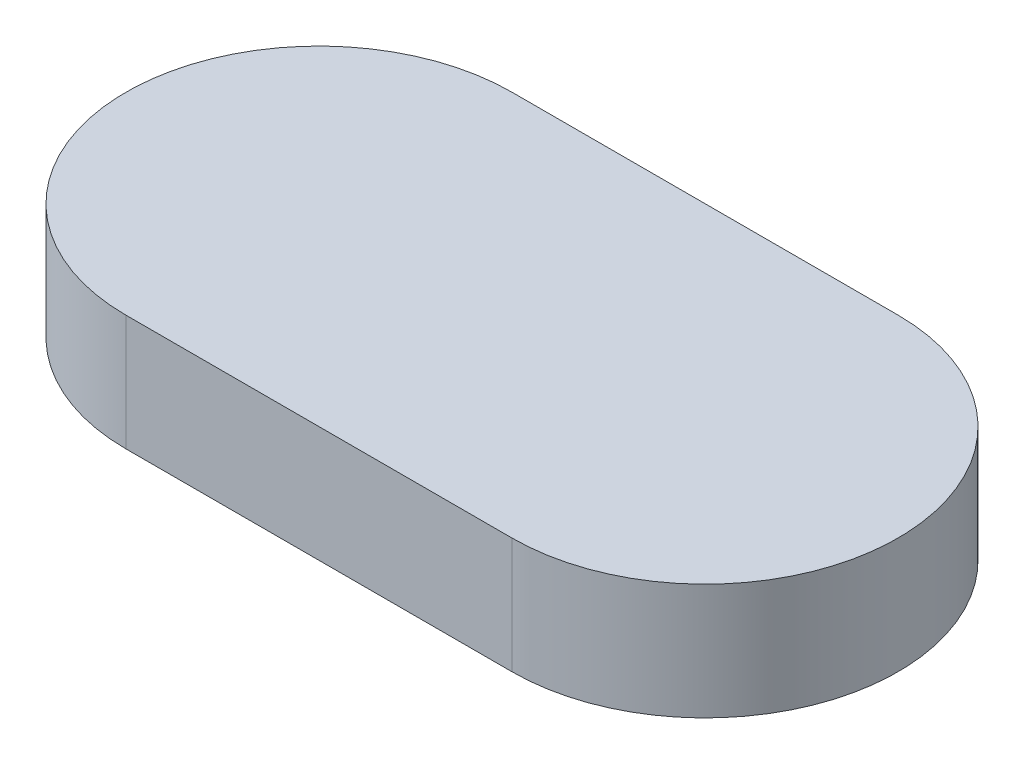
ISO-10303-21;
HEADER;
FILE_DESCRIPTION(('STEP AP214'),'2;1');
FILE_NAME('part.step','',(''),(''),'','','');
FILE_SCHEMA(('AUTOMOTIVE_DESIGN { 1 0 10303 214 1 1 1 1 }'));
ENDSEC;
DATA;
#1=APPLICATION_CONTEXT('core data for automotive mechanical design processes');
#2=APPLICATION_PROTOCOL_DEFINITION('international standard','automotive_design',2000,#1);
#3=PRODUCT_CONTEXT('',#1,'mechanical');
#4=PRODUCT('Part','Part','',(#3));
#5=PRODUCT_RELATED_PRODUCT_CATEGORY('part','',(#4));
#6=PRODUCT_DEFINITION_FORMATION('','',#4);
#7=PRODUCT_DEFINITION_CONTEXT('part definition',#1,'design');
#8=PRODUCT_DEFINITION('design','',#6,#7);
#9=PRODUCT_DEFINITION_SHAPE('','',#8);
#10=(LENGTH_UNIT() NAMED_UNIT(*) SI_UNIT(.MILLI.,.METRE.));
#11=(NAMED_UNIT(*) PLANE_ANGLE_UNIT() SI_UNIT($,.RADIAN.));
#12=(NAMED_UNIT(*) SI_UNIT($,.STERADIAN.) SOLID_ANGLE_UNIT());
#13=UNCERTAINTY_MEASURE_WITH_UNIT(LENGTH_MEASURE(1.E-05),#10,'distance_accuracy_value','');
#14=(GEOMETRIC_REPRESENTATION_CONTEXT(3) GLOBAL_UNCERTAINTY_ASSIGNED_CONTEXT((#13)) GLOBAL_UNIT_ASSIGNED_CONTEXT((#10,
#11,#12)) REPRESENTATION_CONTEXT('',''));
#15=CARTESIAN_POINT('',(0.,0.,0.));
#16=DIRECTION('',(0.,0.,1.));
#17=DIRECTION('',(1.,0.,0.));
#18=AXIS2_PLACEMENT_3D('',#15,#16,#17);
#19=CARTESIAN_POINT('',(-25.,0.,0.));
#20=DIRECTION('',(0.,-1.,0.));
#21=DIRECTION('',(0.,0.,-1.));
#22=AXIS2_PLACEMENT_3D('',#19,#20,#21);
#23=CYLINDRICAL_SURFACE('',#22,25.);
#24=DIRECTION('',(0.,-1.,0.));
#25=VECTOR('',#24,1.);
#26=CARTESIAN_POINT('',(-25.,15.,-25.));
#27=LINE('',#26,#25);
#28=CARTESIAN_POINT('',(-25.,0.,-25.));
#29=VERTEX_POINT('',#28);
#30=CARTESIAN_POINT('',(-25.,15.,-25.));
#31=VERTEX_POINT('',#30);
#32=EDGE_CURVE('E97',#29,#31,#27,.F.);
#33=ORIENTED_EDGE('',*,*,#32,.F.);
#34=CARTESIAN_POINT('',(-25.,0.,0.));
#35=DIRECTION('',(0.,1.,0.));
#36=DIRECTION('',(0.,0.,1.));
#37=AXIS2_PLACEMENT_3D('',#34,#35,#36);
#38=CIRCLE('',#37,25.);
#39=CARTESIAN_POINT('',(-25.,0.,25.));
#40=VERTEX_POINT('',#39);
#41=EDGE_CURVE('E37',#40,#29,#38,.F.);
#42=ORIENTED_EDGE('',*,*,#41,.F.);
#43=DIRECTION('',(0.,-1.,0.));
#44=VECTOR('',#43,1.);
#45=CARTESIAN_POINT('',(-25.,15.,25.));
#46=LINE('',#45,#44);
#47=CARTESIAN_POINT('',(-25.,15.,25.));
#48=VERTEX_POINT('',#47);
#49=EDGE_CURVE('E73',#48,#40,#46,.T.);
#50=ORIENTED_EDGE('',*,*,#49,.F.);
#51=CARTESIAN_POINT('',(-25.,15.,0.));
#52=DIRECTION('',(0.,1.,0.));
#53=DIRECTION('',(0.,0.,1.));
#54=AXIS2_PLACEMENT_3D('',#51,#52,#53);
#55=CIRCLE('',#54,25.);
#56=EDGE_CURVE('E11',#31,#48,#55,.T.);
#57=ORIENTED_EDGE('',*,*,#56,.F.);
#58=EDGE_LOOP('',(#33,#42,#50,#57));
#59=FACE_BOUND('',#58,.T.);
#60=ADVANCED_FACE('F30',(#59),#23,.T.);
#61=CARTESIAN_POINT('',(25.,0.,0.));
#62=DIRECTION('',(0.,-1.,0.));
#63=DIRECTION('',(0.,0.,-1.));
#64=AXIS2_PLACEMENT_3D('',#61,#62,#63);
#65=CYLINDRICAL_SURFACE('',#64,25.);
#66=DIRECTION('',(0.,-1.,0.));
#67=VECTOR('',#66,1.);
#68=CARTESIAN_POINT('',(25.,15.,25.));
#69=LINE('',#68,#67);
#70=CARTESIAN_POINT('',(25.,0.,25.));
#71=VERTEX_POINT('',#70);
#72=CARTESIAN_POINT('',(25.,15.,25.));
#73=VERTEX_POINT('',#72);
#74=EDGE_CURVE('E72',#71,#73,#69,.F.);
#75=ORIENTED_EDGE('',*,*,#74,.F.);
#76=CARTESIAN_POINT('',(25.,0.,0.));
#77=DIRECTION('',(0.,1.,0.));
#78=DIRECTION('',(0.,0.,1.));
#79=AXIS2_PLACEMENT_3D('',#76,#77,#78);
#80=CIRCLE('',#79,25.);
#81=CARTESIAN_POINT('',(25.,0.,-25.));
#82=VERTEX_POINT('',#81);
#83=EDGE_CURVE('E78',#82,#71,#80,.F.);
#84=ORIENTED_EDGE('',*,*,#83,.F.);
#85=DIRECTION('',(0.,-1.,0.));
#86=VECTOR('',#85,1.);
#87=CARTESIAN_POINT('',(25.,15.,-25.));
#88=LINE('',#87,#86);
#89=CARTESIAN_POINT('',(25.,15.,-25.));
#90=VERTEX_POINT('',#89);
#91=EDGE_CURVE('E85',#90,#82,#88,.T.);
#92=ORIENTED_EDGE('',*,*,#91,.F.);
#93=CARTESIAN_POINT('',(25.,15.,0.));
#94=DIRECTION('',(0.,1.,0.));
#95=DIRECTION('',(0.,0.,1.));
#96=AXIS2_PLACEMENT_3D('',#93,#94,#95);
#97=CIRCLE('',#96,25.);
#98=EDGE_CURVE('E84',#73,#90,#97,.T.);
#99=ORIENTED_EDGE('',*,*,#98,.F.);
#100=EDGE_LOOP('',(#75,#84,#92,#99));
#101=FACE_BOUND('',#100,.T.);
#102=ADVANCED_FACE('F88',(#101),#65,.T.);
#103=CARTESIAN_POINT('',(-50.,15.,25.));
#104=DIRECTION('',(0.,0.,-1.));
#105=DIRECTION('',(-1.,0.,0.));
#106=AXIS2_PLACEMENT_3D('',#103,#104,#105);
#107=PLANE('',#106);
#108=DIRECTION('',(1.,0.,0.));
#109=VECTOR('',#108,1.);
#110=CARTESIAN_POINT('',(-50.,15.,25.));
#111=LINE('',#110,#109);
#112=EDGE_CURVE('E92',#48,#73,#111,.T.);
#113=ORIENTED_EDGE('',*,*,#112,.F.);
#114=ORIENTED_EDGE('',*,*,#49,.T.);
#115=DIRECTION('',(1.,0.,0.));
#116=VECTOR('',#115,1.);
#117=CARTESIAN_POINT('',(-50.,0.,25.));
#118=LINE('',#117,#116);
#119=EDGE_CURVE('E67',#40,#71,#118,.T.);
#120=ORIENTED_EDGE('',*,*,#119,.T.);
#121=ORIENTED_EDGE('',*,*,#74,.T.);
#122=EDGE_LOOP('',(#113,#114,#120,#121));
#123=FACE_BOUND('',#122,.T.);
#124=ADVANCED_FACE('F70',(#123),#107,.F.);
#125=CARTESIAN_POINT('',(-50.,15.,-25.));
#126=DIRECTION('',(0.,0.,1.));
#127=DIRECTION('',(1.,0.,0.));
#128=AXIS2_PLACEMENT_3D('',#125,#126,#127);
#129=PLANE('',#128);
#130=DIRECTION('',(-1.,0.,0.));
#131=VECTOR('',#130,1.);
#132=CARTESIAN_POINT('',(-50.,0.,-25.));
#133=LINE('',#132,#131);
#134=EDGE_CURVE('E75',#82,#29,#133,.T.);
#135=ORIENTED_EDGE('',*,*,#134,.T.);
#136=ORIENTED_EDGE('',*,*,#32,.T.);
#137=DIRECTION('',(-1.,0.,0.));
#138=VECTOR('',#137,1.);
#139=CARTESIAN_POINT('',(-50.,15.,-25.));
#140=LINE('',#139,#138);
#141=EDGE_CURVE('E89',#90,#31,#140,.T.);
#142=ORIENTED_EDGE('',*,*,#141,.F.);
#143=ORIENTED_EDGE('',*,*,#91,.T.);
#144=EDGE_LOOP('',(#135,#136,#142,#143));
#145=FACE_BOUND('',#144,.T.);
#146=ADVANCED_FACE('F102',(#145),#129,.F.);
#147=CARTESIAN_POINT('',(-50.,15.,25.));
#148=DIRECTION('',(0.,1.,0.));
#149=DIRECTION('',(0.,0.,1.));
#150=AXIS2_PLACEMENT_3D('',#147,#148,#149);
#151=PLANE('',#150);
#152=ORIENTED_EDGE('',*,*,#141,.T.);
#153=ORIENTED_EDGE('',*,*,#56,.T.);
#154=ORIENTED_EDGE('',*,*,#112,.T.);
#155=ORIENTED_EDGE('',*,*,#98,.T.);
#156=EDGE_LOOP('',(#152,#153,#154,#155));
#157=FACE_BOUND('',#156,.T.);
#158=ADVANCED_FACE('F104',(#157),#151,.T.);
#159=CARTESIAN_POINT('',(-50.,0.,25.));
#160=DIRECTION('',(0.,1.,0.));
#161=DIRECTION('',(0.,0.,1.));
#162=AXIS2_PLACEMENT_3D('',#159,#160,#161);
#163=PLANE('',#162);
#164=ORIENTED_EDGE('',*,*,#119,.F.);
#165=ORIENTED_EDGE('',*,*,#41,.T.);
#166=ORIENTED_EDGE('',*,*,#134,.F.);
#167=ORIENTED_EDGE('',*,*,#83,.T.);
#168=EDGE_LOOP('',(#164,#165,#166,#167));
#169=FACE_BOUND('',#168,.T.);
#170=ADVANCED_FACE('F79',(#169),#163,.F.);
#171=CLOSED_SHELL('',(#60,#102,#124,#146,#158,#170));
#172=MANIFOLD_SOLID_BREP('B2',#171);
#173=ADVANCED_BREP_SHAPE_REPRESENTATION('',(#18,#172),#14);
#174=SHAPE_DEFINITION_REPRESENTATION(#9,#173);
ENDSEC;
END-ISO-10303-21;
